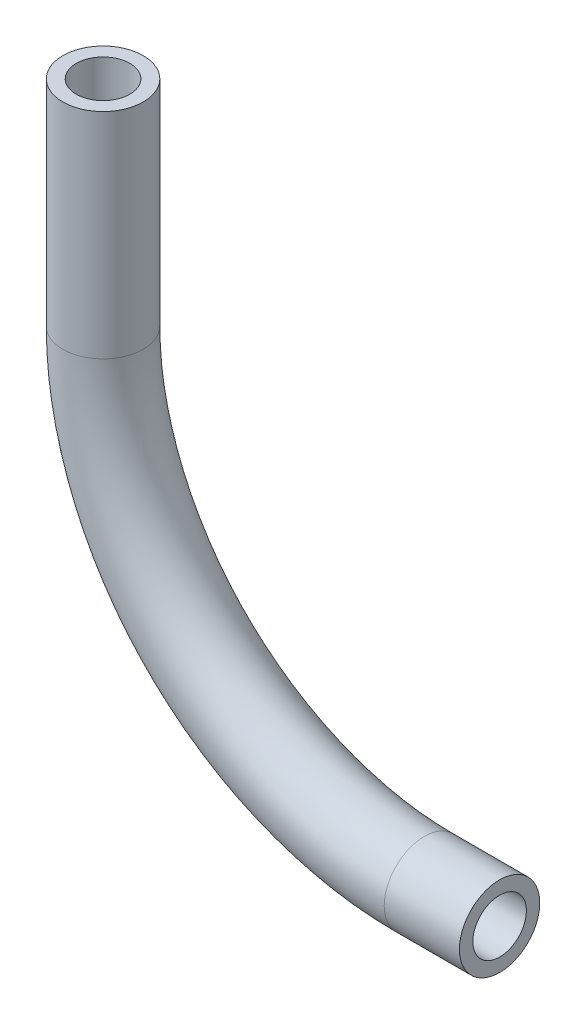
ISO-10303-21;
HEADER;
FILE_DESCRIPTION(('STEP AP214'),'2;1');
FILE_NAME('part.step','',(''),(''),'','','');
FILE_SCHEMA(('AUTOMOTIVE_DESIGN { 1 0 10303 214 1 1 1 1 }'));
ENDSEC;
DATA;
#1=APPLICATION_CONTEXT('core data for automotive mechanical design processes');
#2=APPLICATION_PROTOCOL_DEFINITION('international standard','automotive_design',2000,#1);
#3=PRODUCT_CONTEXT('',#1,'mechanical');
#4=PRODUCT('Part','Part','',(#3));
#5=PRODUCT_RELATED_PRODUCT_CATEGORY('part','',(#4));
#6=PRODUCT_DEFINITION_FORMATION('','',#4);
#7=PRODUCT_DEFINITION_CONTEXT('part definition',#1,'design');
#8=PRODUCT_DEFINITION('design','',#6,#7);
#9=PRODUCT_DEFINITION_SHAPE('','',#8);
#10=(LENGTH_UNIT() NAMED_UNIT(*) SI_UNIT(.MILLI.,.METRE.));
#11=(NAMED_UNIT(*) PLANE_ANGLE_UNIT() SI_UNIT($,.RADIAN.));
#12=(NAMED_UNIT(*) SI_UNIT($,.STERADIAN.) SOLID_ANGLE_UNIT());
#13=UNCERTAINTY_MEASURE_WITH_UNIT(LENGTH_MEASURE(1.E-05),#10,'distance_accuracy_value','');
#14=(GEOMETRIC_REPRESENTATION_CONTEXT(3) GLOBAL_UNCERTAINTY_ASSIGNED_CONTEXT((#13)) GLOBAL_UNIT_ASSIGNED_CONTEXT((#10,
#11,#12)) REPRESENTATION_CONTEXT('',''));
#15=CARTESIAN_POINT('',(0.,0.,0.));
#16=DIRECTION('',(0.,0.,1.));
#17=DIRECTION('',(1.,0.,0.));
#18=AXIS2_PLACEMENT_3D('',#15,#16,#17);
#19=CARTESIAN_POINT('',(-17.8407688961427,-127.,0.));
#20=DIRECTION('',(1.,0.,0.));
#21=DIRECTION('',(0.,1.,0.));
#22=AXIS2_PLACEMENT_3D('',#19,#20,#21);
#23=CYLINDRICAL_SURFACE('',#22,9.52500000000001);
#24=CARTESIAN_POINT('',(-17.8407688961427,-127.,0.));
#25=DIRECTION('',(-1.,0.,0.));
#26=DIRECTION('',(0.,0.,1.));
#27=AXIS2_PLACEMENT_3D('',#24,#25,#26);
#28=CIRCLE('',#27,9.52500000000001);
#29=CARTESIAN_POINT('',(-17.8407688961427,-136.525,0.));
#30=VERTEX_POINT('',#29);
#31=EDGE_CURVE('E10',#30,#30,#28,.T.);
#32=ORIENTED_EDGE('',*,*,#31,.F.);
#33=EDGE_LOOP('',(#32));
#34=FACE_BOUND('',#33,.T.);
#35=CARTESIAN_POINT('',(0.,-127.,0.));
#36=DIRECTION('',(-1.,0.,0.));
#37=DIRECTION('',(0.,0.,1.));
#38=AXIS2_PLACEMENT_3D('',#35,#36,#37);
#39=CIRCLE('',#38,9.52500000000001);
#40=CARTESIAN_POINT('',(0.,-127.,9.52500000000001));
#41=VERTEX_POINT('',#40);
#42=EDGE_CURVE('E56',#41,#41,#39,.T.);
#43=ORIENTED_EDGE('',*,*,#42,.T.);
#44=EDGE_LOOP('',(#43));
#45=FACE_BOUND('',#44,.T.);
#46=ADVANCED_FACE('F35',(#34,#45),#23,.T.);
#47=CARTESIAN_POINT('',(-17.8407688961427,-127.,0.));
#48=DIRECTION('',(1.,0.,0.));
#49=DIRECTION('',(0.,1.,0.));
#50=AXIS2_PLACEMENT_3D('',#47,#48,#49);
#51=CYLINDRICAL_SURFACE('',#50,6.35);
#52=CARTESIAN_POINT('',(0.,-127.,0.));
#53=DIRECTION('',(-1.,0.,0.));
#54=DIRECTION('',(0.,0.,1.));
#55=AXIS2_PLACEMENT_3D('',#52,#53,#54);
#56=CIRCLE('',#55,6.35);
#57=CARTESIAN_POINT('',(0.,-127.,6.35));
#58=VERTEX_POINT('',#57);
#59=EDGE_CURVE('E38',#58,#58,#56,.T.);
#60=ORIENTED_EDGE('',*,*,#59,.F.);
#61=EDGE_LOOP('',(#60));
#62=FACE_BOUND('',#61,.T.);
#63=CARTESIAN_POINT('',(-17.8407688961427,-127.,0.));
#64=DIRECTION('',(-1.,0.,0.));
#65=DIRECTION('',(0.,0.,1.));
#66=AXIS2_PLACEMENT_3D('',#63,#64,#65);
#67=CIRCLE('',#66,6.35);
#68=CARTESIAN_POINT('',(-17.8407688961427,-133.35,0.));
#69=VERTEX_POINT('',#68);
#70=EDGE_CURVE('E42',#69,#69,#67,.T.);
#71=ORIENTED_EDGE('',*,*,#70,.T.);
#72=EDGE_LOOP('',(#71));
#73=FACE_BOUND('',#72,.T.);
#74=ADVANCED_FACE('F70',(#62,#73),#51,.F.);
#75=CARTESIAN_POINT('',(-17.8407688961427,-50.8,0.));
#76=DIRECTION('',(0.,0.,1.));
#77=DIRECTION('',(1.,0.,0.));
#78=AXIS2_PLACEMENT_3D('',#75,#76,#77);
#79=TOROIDAL_SURFACE('',#78,76.2,9.52500000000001);
#80=CARTESIAN_POINT('',(-94.0407688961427,-50.8,0.));
#81=DIRECTION('',(0.,1.,0.));
#82=DIRECTION('',(0.,0.,1.));
#83=AXIS2_PLACEMENT_3D('',#80,#81,#82);
#84=CIRCLE('',#83,9.52500000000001);
#85=CARTESIAN_POINT('',(-103.565768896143,-50.8,0.));
#86=VERTEX_POINT('',#85);
#87=EDGE_CURVE('E46',#86,#86,#84,.T.);
#88=CARTESIAN_POINT('',(-17.8407688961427,-50.8,0.));
#89=DIRECTION('',(0.,0.,1.));
#90=DIRECTION('',(1.,0.,0.));
#91=AXIS2_PLACEMENT_3D('',#88,#89,#90);
#92=CIRCLE('',#91,85.725);
#93=EDGE_CURVE('',#86,#30,#92,.T.);
#94=ORIENTED_EDGE('',*,*,#87,.F.);
#95=ORIENTED_EDGE('',*,*,#31,.T.);
#96=ORIENTED_EDGE('',*,*,#93,.T.);
#97=ORIENTED_EDGE('',*,*,#93,.F.);
#98=EDGE_LOOP('',(#94,#96,#95,#97));
#99=FACE_BOUND('',#98,.T.);
#100=ADVANCED_FACE('F73',(#99),#79,.T.);
#101=CARTESIAN_POINT('',(-17.8407688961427,-50.8,0.));
#102=DIRECTION('',(0.,0.,1.));
#103=DIRECTION('',(1.,0.,0.));
#104=AXIS2_PLACEMENT_3D('',#101,#102,#103);
#105=TOROIDAL_SURFACE('',#104,76.2,6.35);
#106=CARTESIAN_POINT('',(-94.0407688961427,-50.8,0.));
#107=DIRECTION('',(0.,1.,0.));
#108=DIRECTION('',(0.,0.,1.));
#109=AXIS2_PLACEMENT_3D('',#106,#107,#108);
#110=CIRCLE('',#109,6.35);
#111=CARTESIAN_POINT('',(-100.390768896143,-50.8,0.));
#112=VERTEX_POINT('',#111);
#113=EDGE_CURVE('E52',#112,#112,#110,.T.);
#114=CARTESIAN_POINT('',(-17.8407688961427,-50.8,0.));
#115=DIRECTION('',(0.,0.,1.));
#116=DIRECTION('',(1.,0.,0.));
#117=AXIS2_PLACEMENT_3D('',#114,#115,#116);
#118=CIRCLE('',#117,82.55);
#119=EDGE_CURVE('',#112,#69,#118,.T.);
#120=ORIENTED_EDGE('',*,*,#113,.T.);
#121=ORIENTED_EDGE('',*,*,#70,.F.);
#122=ORIENTED_EDGE('',*,*,#119,.T.);
#123=ORIENTED_EDGE('',*,*,#119,.F.);
#124=EDGE_LOOP('',(#120,#122,#121,#123));
#125=FACE_BOUND('',#124,.T.);
#126=ADVANCED_FACE('F76',(#125),#105,.F.);
#127=CARTESIAN_POINT('',(-94.0407688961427,-50.8,0.));
#128=DIRECTION('',(0.,1.,0.));
#129=DIRECTION('',(0.,0.,1.));
#130=AXIS2_PLACEMENT_3D('',#127,#128,#129);
#131=CYLINDRICAL_SURFACE('',#130,6.35);
#132=ORIENTED_EDGE('',*,*,#113,.F.);
#133=EDGE_LOOP('',(#132));
#134=FACE_BOUND('',#133,.T.);
#135=CARTESIAN_POINT('',(-94.0407688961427,0.,0.));
#136=DIRECTION('',(0.,1.,0.));
#137=DIRECTION('',(0.,0.,1.));
#138=AXIS2_PLACEMENT_3D('',#135,#136,#137);
#139=CIRCLE('',#138,6.35);
#140=CARTESIAN_POINT('',(-94.0407688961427,0.,6.35));
#141=VERTEX_POINT('',#140);
#142=EDGE_CURVE('E53',#141,#141,#139,.T.);
#143=ORIENTED_EDGE('',*,*,#142,.T.);
#144=EDGE_LOOP('',(#143));
#145=FACE_BOUND('',#144,.T.);
#146=ADVANCED_FACE('F78',(#134,#145),#131,.F.);
#147=CARTESIAN_POINT('',(-94.0407688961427,-50.8,0.));
#148=DIRECTION('',(0.,1.,0.));
#149=DIRECTION('',(0.,0.,1.));
#150=AXIS2_PLACEMENT_3D('',#147,#148,#149);
#151=CYLINDRICAL_SURFACE('',#150,9.52500000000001);
#152=ORIENTED_EDGE('',*,*,#87,.T.);
#153=EDGE_LOOP('',(#152));
#154=FACE_BOUND('',#153,.T.);
#155=CARTESIAN_POINT('',(-94.0407688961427,0.,0.));
#156=DIRECTION('',(0.,1.,0.));
#157=DIRECTION('',(0.,0.,1.));
#158=AXIS2_PLACEMENT_3D('',#155,#156,#157);
#159=CIRCLE('',#158,9.52500000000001);
#160=CARTESIAN_POINT('',(-94.0407688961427,0.,9.52500000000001));
#161=VERTEX_POINT('',#160);
#162=EDGE_CURVE('E49',#161,#161,#159,.T.);
#163=ORIENTED_EDGE('',*,*,#162,.F.);
#164=EDGE_LOOP('',(#163));
#165=FACE_BOUND('',#164,.T.);
#166=ADVANCED_FACE('F85',(#154,#165),#151,.T.);
#167=CARTESIAN_POINT('',(-94.0407688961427,0.,0.));
#168=DIRECTION('',(0.,1.,0.));
#169=DIRECTION('',(0.,0.,1.));
#170=AXIS2_PLACEMENT_3D('',#167,#168,#169);
#171=PLANE('',#170);
#172=ORIENTED_EDGE('',*,*,#142,.F.);
#173=EDGE_LOOP('',(#172));
#174=FACE_BOUND('',#173,.T.);
#175=ORIENTED_EDGE('',*,*,#162,.T.);
#176=EDGE_LOOP('',(#175));
#177=FACE_BOUND('',#176,.T.);
#178=ADVANCED_FACE('F122',(#174,#177),#171,.T.);
#179=CARTESIAN_POINT('',(0.,-162.293943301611,-9.52500000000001));
#180=DIRECTION('',(-1.,0.,0.));
#181=DIRECTION('',(0.,0.,1.));
#182=AXIS2_PLACEMENT_3D('',#179,#180,#181);
#183=PLANE('',#182);
#184=ORIENTED_EDGE('',*,*,#59,.T.);
#185=EDGE_LOOP('',(#184));
#186=FACE_BOUND('',#185,.T.);
#187=ORIENTED_EDGE('',*,*,#42,.F.);
#188=EDGE_LOOP('',(#187));
#189=FACE_BOUND('',#188,.T.);
#190=ADVANCED_FACE('F67',(#186,#189),#183,.F.);
#191=CLOSED_SHELL('',(#46,#74,#100,#126,#146,#166,#178,#190));
#192=MANIFOLD_SOLID_BREP('B2',#191);
#193=ADVANCED_BREP_SHAPE_REPRESENTATION('',(#18,#192),#14);
#194=SHAPE_DEFINITION_REPRESENTATION(#9,#193);
ENDSEC;
END-ISO-10303-21;
